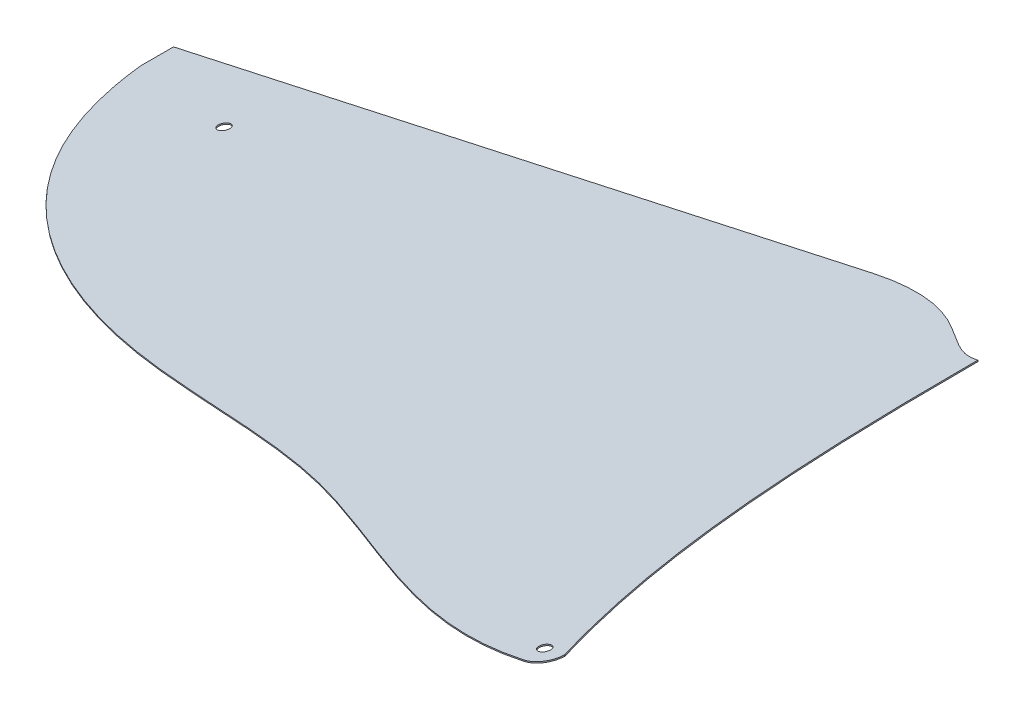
ISO-10303-21;
HEADER;
FILE_DESCRIPTION(('STEP AP214'),'2;1');
FILE_NAME('part.step','',(''),(''),'','','');
FILE_SCHEMA(('AUTOMOTIVE_DESIGN { 1 0 10303 214 1 1 1 1 }'));
ENDSEC;
DATA;
#1=APPLICATION_CONTEXT('core data for automotive mechanical design processes');
#2=APPLICATION_PROTOCOL_DEFINITION('international standard','automotive_design',2000,#1);
#3=PRODUCT_CONTEXT('',#1,'mechanical');
#4=PRODUCT('Part','Part','',(#3));
#5=PRODUCT_RELATED_PRODUCT_CATEGORY('part','',(#4));
#6=PRODUCT_DEFINITION_FORMATION('','',#4);
#7=PRODUCT_DEFINITION_CONTEXT('part definition',#1,'design');
#8=PRODUCT_DEFINITION('design','',#6,#7);
#9=PRODUCT_DEFINITION_SHAPE('','',#8);
#10=(LENGTH_UNIT() NAMED_UNIT(*) SI_UNIT(.MILLI.,.METRE.));
#11=(NAMED_UNIT(*) PLANE_ANGLE_UNIT() SI_UNIT($,.RADIAN.));
#12=(NAMED_UNIT(*) SI_UNIT($,.STERADIAN.) SOLID_ANGLE_UNIT());
#13=UNCERTAINTY_MEASURE_WITH_UNIT(LENGTH_MEASURE(1.E-05),#10,'distance_accuracy_value','');
#14=(GEOMETRIC_REPRESENTATION_CONTEXT(3) GLOBAL_UNCERTAINTY_ASSIGNED_CONTEXT((#13)) GLOBAL_UNIT_ASSIGNED_CONTEXT((#10,
#11,#12)) REPRESENTATION_CONTEXT('',''));
#15=CARTESIAN_POINT('',(0.,0.,0.));
#16=DIRECTION('',(0.,0.,1.));
#17=DIRECTION('',(1.,0.,0.));
#18=AXIS2_PLACEMENT_3D('',#15,#16,#17);
#19=CARTESIAN_POINT('',(-2.617848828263,2.220851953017,-17.129));
#20=DIRECTION('',(-0.21452735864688,0.976717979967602,0.));
#21=DIRECTION('',(-0.976717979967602,-0.21452735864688,0.));
#22=AXIS2_PLACEMENT_3D('',#19,#20,#21);
#23=PLANE('',#22);
#24=CARTESIAN_POINT('',(-142.005271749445,-28.3943473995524,-3.3));
#25=DIRECTION('',(0.214527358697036,-0.976717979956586,0.));
#26=DIRECTION('',(0.976717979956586,0.214527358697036,0.));
#27=AXIS2_PLACEMENT_3D('',#24,#25,#26);
#28=CIRCLE('',#27,1.00000000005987);
#29=CARTESIAN_POINT('',(-141.02855376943,-28.1798200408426,-3.3));
#30=VERTEX_POINT('',#29);
#31=EDGE_CURVE('E96',#30,#30,#28,.F.);
#32=ORIENTED_EDGE('',*,*,#31,.T.);
#33=EDGE_LOOP('',(#32));
#34=FACE_BOUND('',#33,.T.);
#35=CARTESIAN_POINT('',(-9.1716264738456,0.781373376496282,75.2));
#36=DIRECTION('',(0.214527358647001,-0.976717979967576,0.));
#37=DIRECTION('',(0.976717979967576,0.214527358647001,0.));
#38=AXIS2_PLACEMENT_3D('',#35,#36,#37);
#39=CIRCLE('',#38,0.999999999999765);
#40=CARTESIAN_POINT('',(-8.19490849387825,0.995900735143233,75.2));
#41=VERTEX_POINT('',#40);
#42=EDGE_CURVE('E93',#41,#41,#39,.F.);
#43=ORIENTED_EDGE('',*,*,#42,.T.);
#44=EDGE_LOOP('',(#43));
#45=FACE_BOUND('',#44,.T.);
#46=DIRECTION('',(-0.976717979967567,-0.214527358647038,0.));
#47=VECTOR('',#46,1.);
#48=CARTESIAN_POINT('',(-103.2456261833,-19.8811383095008,-15.25));
#49=LINE('',#48,#47);
#50=CARTESIAN_POINT('',(-162.516349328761,-32.8994219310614,-15.25));
#51=VERTEX_POINT('',#50);
#52=CARTESIAN_POINT('',(-43.9748995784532,-6.86285392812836,-15.25));
#53=VERTEX_POINT('',#52);
#54=EDGE_CURVE('E205',#51,#53,#49,.F.);
#55=ORIENTED_EDGE('',*,*,#54,.T.);
#56=CARTESIAN_POINT('',(-43.9748995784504,-6.86285392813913,-15.2500006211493));
#57=CARTESIAN_POINT('',(-43.638383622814,-6.78894121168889,-15.2499893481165));
#58=CARTESIAN_POINT('',(-43.3018689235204,-6.71502877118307,-15.2456346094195));
#59=CARTESIAN_POINT('',(-42.6290148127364,-6.56724239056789,-15.2282786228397));
#60=CARTESIAN_POINT('',(-42.2926754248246,-6.49336845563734,-15.215276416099));
#61=CARTESIAN_POINT('',(-41.6204007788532,-6.34570934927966,-15.1806649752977));
#62=CARTESIAN_POINT('',(-41.284465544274,-6.27192418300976,-15.1590552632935));
#63=CARTESIAN_POINT('',(-40.6132302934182,-6.12449337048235,-15.107197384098));
#64=CARTESIAN_POINT('',(-40.2779302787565,-6.05084772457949,-15.0769491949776));
#65=CARTESIAN_POINT('',(-39.6063469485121,-5.9033404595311,-15.0075456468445));
#66=CARTESIAN_POINT('',(-39.2700683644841,-5.8294798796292,-14.9683422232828));
#67=CARTESIAN_POINT('',(-38.5986238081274,-5.68200309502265,-14.8809927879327));
#68=CARTESIAN_POINT('',(-38.2634578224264,-5.60838688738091,-14.8328468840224));
#69=CARTESIAN_POINT('',(-37.5944850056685,-5.46145299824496,-14.7274338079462));
#70=CARTESIAN_POINT('',(-37.2606782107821,-5.3881353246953,-14.6701663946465));
#71=CARTESIAN_POINT('',(-36.5946826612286,-5.24185536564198,-14.5462817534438));
#72=CARTESIAN_POINT('',(-36.2624941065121,-5.1688931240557,-14.4796633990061));
#73=CARTESIAN_POINT('',(-35.5158923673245,-5.00490873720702,-14.3186593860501));
#74=CARTESIAN_POINT('',(-35.1020415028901,-4.91401010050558,-14.2215198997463));
#75=CARTESIAN_POINT('',(-34.2781137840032,-4.73304175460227,-14.0114914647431));
#76=CARTESIAN_POINT('',(-33.8680373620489,-4.64297214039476,-13.8986007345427));
#77=CARTESIAN_POINT('',(-33.0524576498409,-4.46383735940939,-13.6563359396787));
#78=CARTESIAN_POINT('',(-32.6469552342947,-4.37477238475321,-13.5269587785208));
#79=CARTESIAN_POINT('',(-31.8413790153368,-4.19783478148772,-13.2508208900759));
#80=CARTESIAN_POINT('',(-31.4413082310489,-4.10996281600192,-13.104050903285));
#81=CARTESIAN_POINT('',(-30.6452158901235,-3.93510826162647,-12.7914973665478));
#82=CARTESIAN_POINT('',(-30.2492397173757,-3.84813564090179,-12.6255924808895));
#83=CARTESIAN_POINT('',(-29.4652171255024,-3.6759320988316,-12.2751823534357));
#84=CARTESIAN_POINT('',(-29.077170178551,-3.59070106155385,-12.0906783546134));
#85=CARTESIAN_POINT('',(-28.5021623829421,-3.46440574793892,-11.800025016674));
#86=CARTESIAN_POINT('',(-28.3117910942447,-3.4225923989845,-11.7008929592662));
#87=CARTESIAN_POINT('',(-27.9334261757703,-3.33948793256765,-11.4979715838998));
#88=CARTESIAN_POINT('',(-27.7454325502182,-3.29819681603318,-11.3941822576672));
#89=CARTESIAN_POINT('',(-27.3724244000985,-3.21626891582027,-11.1822377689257));
#90=CARTESIAN_POINT('',(-27.1874035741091,-3.17563074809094,-11.0740942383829));
#91=CARTESIAN_POINT('',(-26.9118365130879,-3.11510491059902,-10.9084662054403));
#92=CARTESIAN_POINT('',(-26.8203082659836,-3.09500155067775,-10.8526881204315));
#93=CARTESIAN_POINT('',(-26.6379255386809,-3.05494281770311,-10.7399890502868));
#94=CARTESIAN_POINT('',(-26.5470710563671,-3.0349874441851,-10.6830680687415));
#95=CARTESIAN_POINT('',(-26.3156768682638,-2.98416378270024,-10.5362145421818));
#96=CARTESIAN_POINT('',(-26.1755967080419,-2.95339642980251,-10.4455227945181));
#97=CARTESIAN_POINT('',(-25.8967790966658,-2.89215663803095,-10.2620057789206));
#98=CARTESIAN_POINT('',(-25.7580416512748,-2.86168420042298,-10.1691805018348));
#99=CARTESIAN_POINT('',(-25.3435022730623,-2.7706343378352,-9.88810561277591));
#100=CARTESIAN_POINT('',(-25.0693808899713,-2.71042603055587,-9.69726182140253));
#101=CARTESIAN_POINT('',(-24.5230830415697,-2.59043659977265,-9.31124411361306));
#102=CARTESIAN_POINT('',(-24.2509131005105,-2.53065690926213,-9.11606061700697));
#103=CARTESIAN_POINT('',(-23.7060150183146,-2.41097492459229,-8.72387508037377));
#104=CARTESIAN_POINT('',(-23.433289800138,-2.35107327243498,-8.52686881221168));
#105=CARTESIAN_POINT('',(-22.8846853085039,-2.23057720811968,-8.13368947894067));
#106=CARTESIAN_POINT('',(-22.6087969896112,-2.16998080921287,-7.93752948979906));
#107=CARTESIAN_POINT('',(-22.1974574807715,-2.07963376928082,-7.65106247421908));
#108=CARTESIAN_POINT('',(-22.0634139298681,-2.05019230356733,-7.55864285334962));
#109=CARTESIAN_POINT('',(-21.7942241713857,-1.99106718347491,-7.37550370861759));
#110=CARTESIAN_POINT('',(-21.6590779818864,-1.961383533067,-7.28478415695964));
#111=CARTESIAN_POINT('',(-21.3874459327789,-1.90172198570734,-7.10551620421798));
#112=CARTESIAN_POINT('',(-21.2509602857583,-1.87174413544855,-7.01696746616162));
#113=CARTESIAN_POINT('',(-20.9763626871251,-1.81143123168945,-6.84252742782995));
#114=CARTESIAN_POINT('',(-20.8382506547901,-1.78109616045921,-6.75663626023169));
#115=CARTESIAN_POINT('',(-20.6301212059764,-1.73538239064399,-6.63049014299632));
#116=CARTESIAN_POINT('',(-20.5608068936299,-1.72015812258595,-6.58901780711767));
#117=CARTESIAN_POINT('',(-20.4216879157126,-1.68960188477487,-6.50694508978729));
#118=CARTESIAN_POINT('',(-20.35188324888,-1.67426991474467,-6.46634471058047));
#119=CARTESIAN_POINT('',(-20.1415647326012,-1.6280753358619,-6.34619867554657));
#120=CARTESIAN_POINT('',(-20.0001393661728,-1.59701252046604,-6.26830382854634));
#121=CARTESIAN_POINT('',(-19.7154303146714,-1.53447872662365,-6.11950854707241));
#122=CARTESIAN_POINT('',(-19.5721756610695,-1.5030141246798,-6.04855040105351));
#123=CARTESIAN_POINT('',(-19.2821359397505,-1.43930949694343,-5.91458743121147));
#124=CARTESIAN_POINT('',(-19.1353509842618,-1.40706949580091,-5.8515823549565));
#125=CARTESIAN_POINT('',(-18.8386906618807,-1.34191071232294,-5.73518222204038));
#126=CARTESIAN_POINT('',(-18.6888263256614,-1.30899435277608,-5.68175788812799));
#127=CARTESIAN_POINT('',(-18.3859650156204,-1.24247357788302,-5.58528745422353));
#128=CARTESIAN_POINT('',(-18.2329687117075,-1.20886930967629,-5.54223915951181));
#129=CARTESIAN_POINT('',(-17.9355675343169,-1.14354780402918,-5.4696394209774));
#130=CARTESIAN_POINT('',(-17.7913362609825,-1.11186869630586,-5.43933988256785));
#131=CARTESIAN_POINT('',(-17.5009449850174,-1.04808685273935,-5.38787146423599));
#132=CARTESIAN_POINT('',(-17.3547809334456,-1.01598322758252,-5.36672660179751));
#133=CARTESIAN_POINT('',(-17.0574774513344,-0.950683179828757,-5.33281378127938));
#134=CARTESIAN_POINT('',(-16.9063116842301,-0.917480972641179,-5.32029202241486));
#135=CARTESIAN_POINT('',(-16.6039704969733,-0.851074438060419,-5.30388748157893));
#136=CARTESIAN_POINT('',(-16.4527963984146,-0.817870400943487,-5.2999795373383));
#137=CARTESIAN_POINT('',(-16.3016677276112,-0.784676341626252,-5.30000000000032));
#138=B_SPLINE_CURVE_WITH_KNOTS('',3,(#56,#57,#58,#59,#60,#61,#62,#63,#64,#65,#66,#67,#68,#69,
#70,#71,#72,#73,#74,#75,#76,#77,#78,#79,#80,#81,#82,#83,#84,#85,#86,#87,#88,#89,#90,#91,#92,#93,
#94,#95,#96,#97,#98,#99,#100,#101,#102,#103,#104,#105,#106,#107,#108,#109,#110,#111,#112,#113,
#114,#115,#116,#117,#118,#119,#120,#121,#122,#123,#124,#125,#126,#127,#128,#129,#130,#131,#132,
#133,#134,#135,#136,#137),.UNSPECIFIED.,.F.,.F.,(4,2,2,2,2,2,2,2,2,2,2,2,2,2,2,2,2,2,2,2,2,2,2,
2,2,2,2,2,2,2,2,2,2,2,2,2,2,2,2,2,4),(0.,1.03358335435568,2.06728133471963,3.10103672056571,
4.13479473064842,5.1742372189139,6.21366716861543,7.25312460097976,8.29270736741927,
9.59653504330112,10.9005103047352,12.2047308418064,13.5096488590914,14.8233506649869,
16.1369647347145,16.7929236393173,17.448883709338,18.1031946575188,18.4303495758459,
18.7575034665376,19.2665430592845,19.7755848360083,20.793695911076,21.8143364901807,
22.8395283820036,23.8711813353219,24.3675410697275,24.8638926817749,25.3601667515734,
25.8564655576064,26.10304826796,26.3496316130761,26.842773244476,27.3313818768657,
27.8199749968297,28.3070486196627,28.7940191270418,29.2459621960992,29.6990838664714,
30.1646589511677,30.6288722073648),.UNSPECIFIED.);
#139=CARTESIAN_POINT('',(-16.3016677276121,-0.784676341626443,-5.30000000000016));
#140=VERTEX_POINT('',#139);
#141=EDGE_CURVE('E133',#53,#140,#138,.T.);
#142=ORIENTED_EDGE('',*,*,#141,.T.);
#143=CARTESIAN_POINT('',(-16.301667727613,-0.784676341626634,-5.30000000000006));
#144=CARTESIAN_POINT('',(-16.3016574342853,-0.784674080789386,-3.53900113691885));
#145=CARTESIAN_POINT('',(-16.2962456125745,-0.783485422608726,-1.7779698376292));
#146=CARTESIAN_POINT('',(-16.271028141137,-0.777946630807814,1.74406631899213));
#147=CARTESIAN_POINT('',(-16.2512217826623,-0.773596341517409,3.50507117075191));
#148=CARTESIAN_POINT('',(-16.1935820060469,-0.760936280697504,7.02934263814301));
#149=CARTESIAN_POINT('',(-16.1557224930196,-0.752620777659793,8.79260883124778));
#150=CARTESIAN_POINT('',(-16.0582885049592,-0.731220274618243,12.3185194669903));
#151=CARTESIAN_POINT('',(-15.9987141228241,-0.718135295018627,14.0811639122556));
#152=CARTESIAN_POINT('',(-15.8541007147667,-0.686372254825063,17.6060376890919));
#153=CARTESIAN_POINT('',(-15.7690521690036,-0.667692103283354,19.3682666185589));
#154=CARTESIAN_POINT('',(-15.5697382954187,-0.62391459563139,22.8909567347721));
#155=CARTESIAN_POINT('',(-15.4554738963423,-0.598817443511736,24.6514179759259));
#156=CARTESIAN_POINT('',(-15.1940779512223,-0.541404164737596,28.1680659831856));
#157=CARTESIAN_POINT('',(-15.0469788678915,-0.509095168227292,29.924255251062));
#158=CARTESIAN_POINT('',(-14.7160806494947,-0.436416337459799,33.4332593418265));
#159=CARTESIAN_POINT('',(-14.5322766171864,-0.396045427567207,35.1860736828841));
#160=CARTESIAN_POINT('',(-14.0760705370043,-0.295843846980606,39.1004718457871));
#161=CARTESIAN_POINT('',(-13.7929959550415,-0.233669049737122,41.2607710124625));
#162=CARTESIAN_POINT('',(-13.1583604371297,-0.0942770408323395,45.5709131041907));
#163=CARTESIAN_POINT('',(-12.8067982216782,-0.0170595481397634,47.7207558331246));
#164=CARTESIAN_POINT('',(-12.0289780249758,0.153781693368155,52.0058063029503));
#165=CARTESIAN_POINT('',(-11.6027364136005,0.247401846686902,54.1410171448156));
#166=CARTESIAN_POINT('',(-10.6671981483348,0.452884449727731,58.4050623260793));
#167=CARTESIAN_POINT('',(-10.1574478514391,0.56484653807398,60.53379325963));
#168=CARTESIAN_POINT('',(-9.32818309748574,0.74698711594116,63.7094277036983));
#169=CARTESIAN_POINT('',(-9.04093213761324,0.810079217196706,64.7652461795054));
#170=CARTESIAN_POINT('',(-8.44439864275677,0.941102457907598,66.8703499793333));
#171=CARTESIAN_POINT('',(-8.13511628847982,1.00903355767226,67.9196353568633));
#172=CARTESIAN_POINT('',(-7.49375193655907,1.14990349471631,70.0120963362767));
#173=CARTESIAN_POINT('',(-7.16164619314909,1.22284754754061,71.0552643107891));
#174=CARTESIAN_POINT('',(-6.47459144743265,1.37375297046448,73.1337213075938));
#175=CARTESIAN_POINT('',(-6.11964168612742,1.45171450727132,74.1690100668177));
#176=CARTESIAN_POINT('',(-5.75311354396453,1.5322191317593,75.2000000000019));
#177=B_SPLINE_CURVE_WITH_KNOTS('',3,(#143,#144,#145,#146,#147,#148,#149,#150,#151,#152,#153,
#154,#155,#156,#157,#158,#159,#160,#161,#162,#163,#164,#165,#166,#167,#168,#169,#170,#171,#172,
#173,#174,#175,#176),.UNSPECIFIED.,.F.,.F.,(4,2,2,2,2,2,2,2,2,2,2,2,2,2,2,2,4),(0.,
5.28303713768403,10.5663344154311,15.8572916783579,21.1482263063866,26.4411406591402,
31.7338867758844,37.0214231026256,42.3096653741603,48.8475669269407,55.385590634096,
61.9221829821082,68.4955390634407,71.7833727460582,75.0711794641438,78.3624602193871,
81.6538503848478),.UNSPECIFIED.);
#178=CARTESIAN_POINT('',(-5.75311354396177,1.53221913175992,75.2000000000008));
#179=VERTEX_POINT('',#178);
#180=EDGE_CURVE('E77',#140,#179,#177,.T.);
#181=ORIENTED_EDGE('',*,*,#180,.T.);
#182=CARTESIAN_POINT('',(-9.17162647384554,0.781373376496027,75.2));
#183=DIRECTION('',(0.214527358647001,-0.976717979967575,0.));
#184=DIRECTION('',(0.976717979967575,0.214527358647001,0.));
#185=AXIS2_PLACEMENT_3D('',#182,#183,#184);
#186=CIRCLE('',#185,3.50000000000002);
#187=CARTESIAN_POINT('',(-9.17162647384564,0.781373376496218,78.7));
#188=VERTEX_POINT('',#187);
#189=EDGE_CURVE('E72',#179,#188,#186,.T.);
#190=ORIENTED_EDGE('',*,*,#189,.T.);
#191=CARTESIAN_POINT('',(-9.17162647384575,0.781373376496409,78.7000000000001));
#192=CARTESIAN_POINT('',(-9.577487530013,0.692229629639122,78.7000044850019));
#193=CARTESIAN_POINT('',(-9.98332844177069,0.603090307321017,78.6946243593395));
#194=CARTESIAN_POINT('',(-10.7947311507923,0.424872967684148,78.6732559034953));
#195=CARTESIAN_POINT('',(-11.2002929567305,0.335794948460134,78.657267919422));
#196=CARTESIAN_POINT('',(-12.4125616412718,0.0695309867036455,78.5938257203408));
#197=CARTESIAN_POINT('',(-13.2185402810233,-0.107495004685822,78.5308899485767));
#198=CARTESIAN_POINT('',(-14.8243866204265,-0.460204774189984,78.3656484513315));
#199=CARTESIAN_POINT('',(-15.6242649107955,-0.635890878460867,78.2634487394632));
#200=CARTESIAN_POINT('',(-17.2176584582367,-0.985865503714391,78.0220973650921));
#201=CARTESIAN_POINT('',(-18.0111803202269,-1.16015547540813,77.8829912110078));
#202=CARTESIAN_POINT('',(-19.5915761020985,-1.50727525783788,77.5704076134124));
#203=CARTESIAN_POINT('',(-20.378451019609,-1.68010528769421,77.3969354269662));
#204=CARTESIAN_POINT('',(-21.9289911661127,-2.02066754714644,77.0222875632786));
#205=CARTESIAN_POINT('',(-22.6928032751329,-2.18843203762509,76.8217458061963));
#206=CARTESIAN_POINT('',(-24.2135412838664,-2.52244852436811,76.3930077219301));
#207=CARTESIAN_POINT('',(-24.9704618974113,-2.6886993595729,76.1647918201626));
#208=CARTESIAN_POINT('',(-26.4772201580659,-3.01964531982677,75.683472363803));
#209=CARTESIAN_POINT('',(-27.2270529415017,-3.18433937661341,75.430352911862));
#210=CARTESIAN_POINT('',(-28.7194635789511,-3.51213400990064,74.9020575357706));
#211=CARTESIAN_POINT('',(-29.4620394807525,-3.67523415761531,74.6268758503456));
#212=CARTESIAN_POINT('',(-30.9397718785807,-3.99980484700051,74.0573319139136));
#213=CARTESIAN_POINT('',(-31.6749312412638,-4.16127601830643,73.7629774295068));
#214=CARTESIAN_POINT('',(-33.4623559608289,-4.55386785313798,73.0237033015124));
#215=CARTESIAN_POINT('',(-34.5110626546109,-4.78420688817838,72.5697717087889));
#216=CARTESIAN_POINT('',(-36.5961047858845,-5.24216772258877,71.6348872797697));
#217=CARTESIAN_POINT('',(-37.6324470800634,-5.46979102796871,71.1539503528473));
#218=CARTESIAN_POINT('',(-39.6960167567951,-5.92303563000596,70.1716063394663));
#219=CARTESIAN_POINT('',(-40.723242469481,-6.14865655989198,69.6701955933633));
#220=CARTESIAN_POINT('',(-42.771672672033,-6.59857591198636,68.6531836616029));
#221=CARTESIAN_POINT('',(-43.7928733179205,-6.82287348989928,68.137574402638));
#222=CARTESIAN_POINT('',(-45.8322698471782,-7.27080867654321,67.0982660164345));
#223=CARTESIAN_POINT('',(-46.8504629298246,-7.49444567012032,66.5745611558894));
#224=CARTESIAN_POINT('',(-48.8868213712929,-7.94171356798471,65.5250837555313));
#225=CARTESIAN_POINT('',(-49.9049860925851,-8.16534433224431,64.9993099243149));
#226=CARTESIAN_POINT('',(-51.950695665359,-8.61466612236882,63.9484289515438));
#227=CARTESIAN_POINT('',(-52.9782558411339,-8.84036051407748,63.4233529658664));
#228=CARTESIAN_POINT('',(-55.0385223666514,-9.29287960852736,62.3839409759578));
#229=CARTESIAN_POINT('',(-56.0712284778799,-9.51970425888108,61.8696044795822));
#230=CARTESIAN_POINT('',(-57.6259265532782,-9.8611797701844,61.1112487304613));
#231=CARTESIAN_POINT('',(-58.1449001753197,-9.97516767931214,60.8607479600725));
#232=CARTESIAN_POINT('',(-59.1852003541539,-10.2036602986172,60.3649105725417));
#233=CARTESIAN_POINT('',(-59.7065269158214,-10.3181650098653,60.1195739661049));
#234=CARTESIAN_POINT('',(-60.7512335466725,-10.5476254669,59.6352295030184));
#235=CARTESIAN_POINT('',(-61.2746104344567,-10.6625805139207,59.3962144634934));
#236=CARTESIAN_POINT('',(-62.3243347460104,-10.8931430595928,58.9251195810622));
#237=CARTESIAN_POINT('',(-62.8506821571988,-11.0087505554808,58.6930397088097));
#238=CARTESIAN_POINT('',(-63.9059951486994,-11.2405406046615,58.2370076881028));
#239=CARTESIAN_POINT('',(-64.4349568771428,-11.3567223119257,58.013046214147));
#240=CARTESIAN_POINT('',(-65.496375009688,-11.5898533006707,57.5739799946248));
#241=CARTESIAN_POINT('',(-66.0288314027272,-11.7068025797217,57.3588752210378));
#242=CARTESIAN_POINT('',(-67.0964090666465,-11.9412864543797,56.9373343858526));
#243=CARTESIAN_POINT('',(-67.6315272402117,-12.0588203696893,56.7308900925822));
#244=CARTESIAN_POINT('',(-68.7046255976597,-12.294516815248,56.3259442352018));
#245=CARTESIAN_POINT('',(-69.2426058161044,-12.4126793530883,56.1274427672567));
#246=CARTESIAN_POINT('',(-70.6667712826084,-12.725484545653,55.6130283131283));
#247=CARTESIAN_POINT('',(-71.555128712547,-12.9206043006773,55.3034075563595));
#248=CARTESIAN_POINT('',(-73.3375103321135,-13.3120884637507,54.7017795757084));
#249=CARTESIAN_POINT('',(-74.2315346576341,-13.5084529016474,54.4097727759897));
#250=CARTESIAN_POINT('',(-76.9221975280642,-14.0994329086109,53.5558157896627));
#251=CARTESIAN_POINT('',(-78.7256936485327,-14.4955546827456,53.016543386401));
#252=CARTESIAN_POINT('',(-82.3464464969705,-15.2908206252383,51.9761251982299));
#253=CARTESIAN_POINT('',(-84.1637222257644,-15.6899689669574,51.475050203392));
#254=CARTESIAN_POINT('',(-87.8059527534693,-16.4899522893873,50.4889992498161));
#255=CARTESIAN_POINT('',(-89.6309155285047,-16.8907890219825,50.004054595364));
#256=CARTESIAN_POINT('',(-93.2823713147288,-17.6927985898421,49.0282485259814));
#257=CARTESIAN_POINT('',(-95.1088623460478,-18.0939709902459,48.5373791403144));
#258=CARTESIAN_POINT('',(-97.8445398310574,-18.6948380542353,47.7805401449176));
#259=CARTESIAN_POINT('',(-98.7563712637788,-18.8951136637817,47.524657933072));
#260=CARTESIAN_POINT('',(-100.57748157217,-19.295104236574,47.0035136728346));
#261=CARTESIAN_POINT('',(-101.486760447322,-19.4948191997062,46.7382516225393));
#262=CARTESIAN_POINT('',(-103.291558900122,-19.8912270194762,46.198885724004));
#263=CARTESIAN_POINT('',(-104.187117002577,-20.0879283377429,45.9249174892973));
#264=CARTESIAN_POINT('',(-105.974030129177,-20.4804078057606,45.3629421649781));
#265=CARTESIAN_POINT('',(-106.865385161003,-20.6761859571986,45.074935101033));
#266=CARTESIAN_POINT('',(-108.642794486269,-21.0665780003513,44.4826860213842));
#267=CARTESIAN_POINT('',(-109.528849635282,-21.2611920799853,44.1784467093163));
#268=CARTESIAN_POINT('',(-110.853255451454,-21.5520859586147,43.7082990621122));
#269=CARTESIAN_POINT('',(-111.293946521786,-21.6488798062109,43.5492843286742));
#270=CARTESIAN_POINT('',(-112.17364595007,-21.8420979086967,43.2264491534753));
#271=CARTESIAN_POINT('',(-112.612654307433,-21.9385221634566,43.0626287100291));
#272=CARTESIAN_POINT('',(-113.925861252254,-22.2269563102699,42.5643679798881));
#273=CARTESIAN_POINT('',(-114.797456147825,-22.4183943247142,42.2226977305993));
#274=CARTESIAN_POINT('',(-116.533026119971,-22.7995967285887,41.5196233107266));
#275=CARTESIAN_POINT('',(-117.397001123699,-22.9893611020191,41.1582189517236));
#276=CARTESIAN_POINT('',(-119.115156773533,-23.3667386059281,40.4158036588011));
#277=CARTESIAN_POINT('',(-119.969351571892,-23.5543548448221,40.0348270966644));
#278=CARTESIAN_POINT('',(-121.668624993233,-23.9275850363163,39.2521380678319));
#279=CARTESIAN_POINT('',(-122.513703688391,-24.1131990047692,38.8504257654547));
#280=CARTESIAN_POINT('',(-124.192553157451,-24.4819432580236,38.0262671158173));
#281=CARTESIAN_POINT('',(-125.026339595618,-24.6650769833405,37.6038542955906));
#282=CARTESIAN_POINT('',(-126.682910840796,-25.028928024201,36.7370402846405));
#283=CARTESIAN_POINT('',(-127.505695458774,-25.2096452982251,36.292638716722));
#284=CARTESIAN_POINT('',(-129.954721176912,-25.7475518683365,34.9259950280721));
#285=CARTESIAN_POINT('',(-131.563104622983,-26.1008188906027,33.9695964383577));
#286=CARTESIAN_POINT('',(-133.863799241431,-26.6061458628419,32.5051059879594));
#287=CARTESIAN_POINT('',(-134.579626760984,-26.7633709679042,32.0353497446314));
#288=CARTESIAN_POINT('',(-135.997900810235,-27.0748821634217,31.0747021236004));
#289=CARTESIAN_POINT('',(-136.700344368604,-27.2291676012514,30.5838061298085));
#290=CARTESIAN_POINT('',(-138.090373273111,-27.5344750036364,29.5803009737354));
#291=CARTESIAN_POINT('',(-138.777957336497,-27.6854966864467,29.0676899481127));
#292=CARTESIAN_POINT('',(-140.136792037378,-27.9839525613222,28.0200898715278));
#293=CARTESIAN_POINT('',(-140.808041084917,-28.1313864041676,27.4850986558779));
#294=CARTESIAN_POINT('',(-142.135427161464,-28.4229348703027,26.3897493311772));
#295=CARTESIAN_POINT('',(-142.791484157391,-28.5670319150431,25.8292894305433));
#296=CARTESIAN_POINT('',(-144.08356301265,-28.8508254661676,24.6846548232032));
#297=CARTESIAN_POINT('',(-144.719585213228,-28.9905220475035,24.1004805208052));
#298=CARTESIAN_POINT('',(-145.969576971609,-29.2650715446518,22.9079613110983));
#299=CARTESIAN_POINT('',(-146.58354812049,-29.3999248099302,22.299618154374));
#300=CARTESIAN_POINT('',(-147.787403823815,-29.6643409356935,21.0582892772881));
#301=CARTESIAN_POINT('',(-148.377285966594,-29.7939032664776,20.4253011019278));
#302=CARTESIAN_POINT('',(-149.537848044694,-30.0488103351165,19.1264199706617));
#303=CARTESIAN_POINT('',(-150.108194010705,-30.174081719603,18.4602137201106));
#304=CARTESIAN_POINT('',(-151.219334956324,-30.4181338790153,17.102300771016));
#305=CARTESIAN_POINT('',(-151.760126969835,-30.5369140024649,16.4105915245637));
#306=CARTESIAN_POINT('',(-152.809441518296,-30.7673865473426,15.002005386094));
#307=CARTESIAN_POINT('',(-153.317966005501,-30.8790793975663,14.2851300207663));
#308=CARTESIAN_POINT('',(-154.300350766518,-31.0948514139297,12.8268132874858));
#309=CARTESIAN_POINT('',(-154.774209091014,-31.1989301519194,12.0853705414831));
#310=CARTESIAN_POINT('',(-155.683650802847,-31.3986808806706,10.5816112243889));
#311=CARTESIAN_POINT('',(-156.119354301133,-31.4943792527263,9.81937085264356));
#312=CARTESIAN_POINT('',(-156.952498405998,-31.677371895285,8.27314514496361));
#313=CARTESIAN_POINT('',(-157.349934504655,-31.7646651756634,7.48915726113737));
#314=CARTESIAN_POINT('',(-158.105062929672,-31.9305223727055,5.90155756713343));
#315=CARTESIAN_POINT('',(-158.462762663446,-32.0090879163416,5.09794944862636));
#316=CARTESIAN_POINT('',(-159.137479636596,-32.1572834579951,3.47343515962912));
#317=CARTESIAN_POINT('',(-159.45451585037,-32.2269176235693,2.65253726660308));
#318=CARTESIAN_POINT('',(-159.916133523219,-32.3283078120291,1.363023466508));
#319=CARTESIAN_POINT('',(-160.074835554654,-32.3631652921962,0.899650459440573));
#320=CARTESIAN_POINT('',(-160.379564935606,-32.4300963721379,-0.0313283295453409));
#321=CARTESIAN_POINT('',(-160.525595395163,-32.462170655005,-0.498933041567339));
#322=CARTESIAN_POINT('',(-160.805049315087,-32.5235502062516,-1.43800944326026));
#323=CARTESIAN_POINT('',(-160.938474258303,-32.5528558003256,-1.90948067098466));
#324=CARTESIAN_POINT('',(-161.192827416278,-32.6087221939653,-2.85593161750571));
#325=CARTESIAN_POINT('',(-161.313755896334,-32.6352830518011,-3.33091126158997));
#326=CARTESIAN_POINT('',(-161.543470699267,-32.6857378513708,-4.2849013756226));
#327=CARTESIAN_POINT('',(-161.6522333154,-32.7096265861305,-4.76391782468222));
#328=CARTESIAN_POINT('',(-161.857524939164,-32.7547170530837,-5.724713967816));
#329=CARTESIAN_POINT('',(-161.954053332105,-32.775918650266,-6.20649379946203));
#330=CARTESIAN_POINT('',(-162.135075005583,-32.8156784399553,-7.17242951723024));
#331=CARTESIAN_POINT('',(-162.219567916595,-32.834236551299,-7.65658547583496));
#332=CARTESIAN_POINT('',(-162.376750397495,-32.8687602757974,-8.62688620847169));
#333=CARTESIAN_POINT('',(-162.449440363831,-32.8847259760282,-9.11303091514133));
#334=CARTESIAN_POINT('',(-162.516349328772,-32.8994219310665,-9.60000000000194));
#335=B_SPLINE_CURVE_WITH_KNOTS('',3,(#191,#192,#193,#194,#195,#196,#197,#198,#199,#200,#201,
#202,#203,#204,#205,#206,#207,#208,#209,#210,#211,#212,#213,#214,#215,#216,#217,#218,#219,#220,
#221,#222,#223,#224,#225,#226,#227,#228,#229,#230,#231,#232,#233,#234,#235,#236,#237,#238,#239,
#240,#241,#242,#243,#244,#245,#246,#247,#248,#249,#250,#251,#252,#253,#254,#255,#256,#257,#258,
#259,#260,#261,#262,#263,#264,#265,#266,#267,#268,#269,#270,#271,#272,#273,#274,#275,#276,#277,
#278,#279,#280,#281,#282,#283,#284,#285,#286,#287,#288,#289,#290,#291,#292,#293,#294,#295,#296,
#297,#298,#299,#300,#301,#302,#303,#304,#305,#306,#307,#308,#309,#310,#311,#312,#313,#314,#315,
#316,#317,#318,#319,#320,#321,#322,#323,#324,#325,#326,#327,#328,#329,#330,#331,#332,#333,#334),
.UNSPECIFIED.,.F.,.F.,(4,2,2,2,2,2,2,2,2,2,2,2,2,2,2,2,2,2,2,2,2,2,2,2,2,2,2,2,2,2,2,2,2,2,2,2,
2,2,2,2,2,2,2,2,2,2,2,2,2,2,2,2,2,2,2,2,2,2,2,2,2,2,2,2,2,2,2,2,2,2,2,4),(0.,1.24653279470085,
2.49302492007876,4.97469310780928,7.44970729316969,9.92168367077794,12.3932821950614,
14.8147034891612,17.237847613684,19.6625487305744,22.087885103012,24.5122450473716,
28.0088698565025,31.5034559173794,34.9986693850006,38.495913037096,41.9957585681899,
45.4983262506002,49.0257268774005,52.5529655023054,54.3152418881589,56.077521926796,
57.8377051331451,59.5978808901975,61.3559661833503,63.1140459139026,64.8704148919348,
66.6268051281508,69.5089457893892,72.3911558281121,78.1612037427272,83.9416974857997,
89.7328227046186,95.5328780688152,98.4368372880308,101.340797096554,104.211584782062,
107.082367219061,109.952672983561,111.38783863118,112.823004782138,115.689390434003,
118.555803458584,121.417344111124,124.278862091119,127.135889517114,129.992965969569,
135.702121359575,138.313402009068,140.92525577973,143.537334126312,146.149665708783,
148.773559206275,151.397407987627,154.021067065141,156.644988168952,159.301845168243,
161.958968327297,164.615930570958,167.273042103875,169.921463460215,172.570196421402,
175.218434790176,177.865432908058,179.338376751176,180.810958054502,182.283365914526,
183.755742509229,185.230939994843,186.706211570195,188.181528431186,189.656795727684),.UNSPECIFIED.);
#336=CARTESIAN_POINT('',(-162.516349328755,-32.8994219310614,-9.60000000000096));
#337=VERTEX_POINT('',#336);
#338=EDGE_CURVE('E21',#188,#337,#335,.T.);
#339=ORIENTED_EDGE('',*,*,#338,.T.);
#340=DIRECTION('',(0.,0.,1.));
#341=VECTOR('',#340,1.);
#342=CARTESIAN_POINT('',(-162.516349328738,-32.8994219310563,-12.4249999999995));
#343=LINE('',#342,#341);
#344=EDGE_CURVE('E200',#337,#51,#343,.F.);
#345=ORIENTED_EDGE('',*,*,#344,.T.);
#346=EDGE_LOOP('',(#55,#142,#181,#190,#339,#345));
#347=FACE_BOUND('',#346,.T.);
#348=ADVANCED_FACE('F16',(#34,#45,#347),#23,.F.);
#349=CARTESIAN_POINT('',(-7.362769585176,1.387535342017,78.66247188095));
#350=CARTESIAN_POINT('',(-7.983154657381,1.251273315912,78.6876692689));
#351=CARTESIAN_POINT('',(-28.90687387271,-3.34443425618,79.1054902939));
#352=CARTESIAN_POINT('',(-60.66998569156,-10.32091735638,54.51567693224));
#353=CARTESIAN_POINT('',(-112.3091784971,-21.66300367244,46.67202631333));
#354=CARTESIAN_POINT('',(-151.460288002,-30.26219431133,23.49322009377));
#355=CARTESIAN_POINT('',(-161.4828484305,-32.46355996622,-0.682376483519));
#356=CARTESIAN_POINT('',(-162.7245564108,-32.73629000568,-10.86872133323));
#357=CARTESIAN_POINT('',(-162.7931592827,-32.75135801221,-11.51289203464));
#358=B_SPLINE_CURVE_WITH_KNOTS('',3,(#349,#350,#351,#352,#353,#354,#355,#356,#357),
.UNSPECIFIED.,.F.,.F.,(4,1,1,1,1,1,4),(0.,0.009666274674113,0.3275371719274,0.5861839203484,
0.8538980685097,0.9908550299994,1.),.UNSPECIFIED.);
#359=DIRECTION('',(0.214527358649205,-0.976717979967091,0.));
#360=VECTOR('',#359,1.);
#361=SURFACE_OF_LINEAR_EXTRUSION('',#358,#360);
#362=ORIENTED_EDGE('',*,*,#338,.F.);
#363=DIRECTION('',(-0.214527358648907,0.976717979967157,0.));
#364=VECTOR('',#363,1.);
#365=CARTESIAN_POINT('',(-9.1930792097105,0.87904517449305,78.7));
#366=LINE('',#365,#364);
#367=CARTESIAN_POINT('',(-9.21453194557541,0.976716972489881,78.7));
#368=VERTEX_POINT('',#367);
#369=EDGE_CURVE('E80',#188,#368,#366,.T.);
#370=ORIENTED_EDGE('',*,*,#369,.T.);
#371=CARTESIAN_POINT('',(-9.21453195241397,0.976716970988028,78.7000000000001));
#372=CARTESIAN_POINT('',(-9.62039300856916,0.887573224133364,78.7000044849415));
#373=CARTESIAN_POINT('',(-10.026233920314,0.798433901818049,78.6946243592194));
#374=CARTESIAN_POINT('',(-10.8376366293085,0.620216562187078,78.6732559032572));
#375=CARTESIAN_POINT('',(-11.2431984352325,0.531138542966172,78.6572679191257));
#376=CARTESIAN_POINT('',(-12.4554671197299,0.264874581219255,78.593825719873));
#377=CARTESIAN_POINT('',(-13.2614457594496,0.0878485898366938,78.5308899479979));
#378=CARTESIAN_POINT('',(-14.8672920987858,-0.264861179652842,78.3656484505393));
#379=CARTESIAN_POINT('',(-15.6671703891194,-0.440547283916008,78.2634487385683));
#380=CARTESIAN_POINT('',(-17.260563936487,-0.79052190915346,78.0220973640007));
#381=CARTESIAN_POINT('',(-18.0540857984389,-0.964811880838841,77.8829912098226));
#382=CARTESIAN_POINT('',(-19.6344815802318,-1.31193166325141,77.5704076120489));
#383=CARTESIAN_POINT('',(-20.421356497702,-1.48476169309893,77.3969354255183));
#384=CARTESIAN_POINT('',(-21.9718966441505,-1.82532395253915,77.0222875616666));
#385=CARTESIAN_POINT('',(-22.7357087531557,-1.99308844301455,76.8217458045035));
#386=CARTESIAN_POINT('',(-24.2564467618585,-2.32710492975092,76.393007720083));
#387=CARTESIAN_POINT('',(-25.0133673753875,-2.49335576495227,76.1647918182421));
#388=CARTESIAN_POINT('',(-26.5201256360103,-2.82430172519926,75.6834723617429));
#389=CARTESIAN_POINT('',(-27.2699584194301,-2.98899578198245,75.4303529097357));
#390=CARTESIAN_POINT('',(-28.7623690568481,-3.31679041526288,74.9020575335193));
#391=CARTESIAN_POINT('',(-29.5049449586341,-3.47989056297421,74.6268758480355));
#392=CARTESIAN_POINT('',(-30.9826773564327,-3.804461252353,74.0573319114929));
#393=CARTESIAN_POINT('',(-31.7178367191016,-3.96593242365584,73.7629774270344));
#394=CARTESIAN_POINT('',(-33.5052614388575,-4.35852425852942,73.0237032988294));
#395=CARTESIAN_POINT('',(-34.5539681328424,-4.58886329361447,72.5697717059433));
#396=CARTESIAN_POINT('',(-36.6390102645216,-5.04682412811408,71.6348872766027));
#397=CARTESIAN_POINT('',(-37.6753525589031,-5.27444743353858,71.1539503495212));
#398=CARTESIAN_POINT('',(-39.7389222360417,-5.72769203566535,70.1716063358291));
#399=CARTESIAN_POINT('',(-40.7661479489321,-5.95331296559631,69.670195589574));
#400=CARTESIAN_POINT('',(-42.8145781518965,-6.40323231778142,68.65318365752));
#401=CARTESIAN_POINT('',(-43.8357787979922,-6.62752989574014,68.1375743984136));
#402=CARTESIAN_POINT('',(-45.8751753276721,-7.07546508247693,67.098266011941));
#403=CARTESIAN_POINT('',(-46.8933684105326,-7.29910207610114,66.5745611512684));
#404=CARTESIAN_POINT('',(-48.9297268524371,-7.74636997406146,65.5250837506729));
#405=CARTESIAN_POINT('',(-49.9478915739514,-7.97000073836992,64.9993099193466));
#406=CARTESIAN_POINT('',(-51.9936011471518,-8.41932252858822,63.9484289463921));
#407=CARTESIAN_POINT('',(-53.0211613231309,-8.64501692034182,63.423352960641));
#408=CARTESIAN_POINT('',(-55.0814278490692,-9.09753601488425,62.3839409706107));
#409=CARTESIAN_POINT('',(-56.114133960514,-9.32436066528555,61.8696044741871));
#410=CARTESIAN_POINT('',(-57.6688320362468,-9.66583617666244,61.1112487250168));
#411=CARTESIAN_POINT('',(-58.1878056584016,-9.77982408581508,60.8607479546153));
#412=CARTESIAN_POINT('',(-59.2281058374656,-10.0083167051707,60.3649105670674));
#413=CARTESIAN_POINT('',(-59.7494323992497,-10.1228214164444,60.1195739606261));
#414=CARTESIAN_POINT('',(-60.794139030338,-10.3522818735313,59.6352294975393));
#415=CARTESIAN_POINT('',(-61.3175159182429,-10.4672369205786,59.3962144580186));
#416=CARTESIAN_POINT('',(-62.3672402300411,-10.6977994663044,58.9251195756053));
#417=CARTESIAN_POINT('',(-62.8935876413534,-10.8134069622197,58.6930397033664));
#418=CARTESIAN_POINT('',(-63.9489006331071,-11.0451970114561,58.237007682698));
#419=CARTESIAN_POINT('',(-64.4778623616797,-11.1613787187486,58.0130462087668));
#420=CARTESIAN_POINT('',(-65.5392804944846,-11.3945097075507,57.5739799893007));
#421=CARTESIAN_POINT('',(-66.0717368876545,-11.5114589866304,57.3588752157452));
#422=CARTESIAN_POINT('',(-67.1393145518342,-11.7459428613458,56.9373343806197));
#423=CARTESIAN_POINT('',(-67.6744327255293,-11.863476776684,56.7308900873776));
#424=CARTESIAN_POINT('',(-68.7475310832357,-12.0991732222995,56.3259442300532));
#425=CARTESIAN_POINT('',(-69.2855113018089,-12.217335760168,56.1274427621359));
#426=CARTESIAN_POINT('',(-70.7096767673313,-12.5301409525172,55.6130283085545));
#427=CARTESIAN_POINT('',(-71.5980341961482,-12.7252607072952,55.3034075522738));
#428=CARTESIAN_POINT('',(-73.3804158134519,-13.1167448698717,54.7017795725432));
#429=CARTESIAN_POINT('',(-74.2744401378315,-13.3131093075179,54.409772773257));
#430=CARTESIAN_POINT('',(-76.9651030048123,-13.9040893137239,53.5558157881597));
#431=CARTESIAN_POINT('',(-78.7685991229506,-14.3002110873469,53.0165433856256));
#432=CARTESIAN_POINT('',(-82.3893519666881,-15.0954770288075,51.9761251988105));
#433=CARTESIAN_POINT('',(-84.206627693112,-15.4946253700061,51.4750502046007));
#434=CARTESIAN_POINT('',(-87.8488582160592,-16.2946086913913,50.4889992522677));
#435=CARTESIAN_POINT('',(-89.673820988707,-16.6954454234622,50.0040545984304));
#436=CARTESIAN_POINT('',(-93.3252767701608,-17.4974549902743,49.0282485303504));
#437=CARTESIAN_POINT('',(-95.1517677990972,-17.8986273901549,48.5373791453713));
#438=CARTESIAN_POINT('',(-97.8874452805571,-18.4994944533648,47.7805401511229));
#439=CARTESIAN_POINT('',(-98.7992767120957,-18.6997700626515,47.5246579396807));
#440=CARTESIAN_POINT('',(-100.620387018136,-19.0997606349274,47.0035136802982));
#441=CARTESIAN_POINT('',(-101.529665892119,-19.2994755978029,46.7382516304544));
#442=CARTESIAN_POINT('',(-103.334464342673,-19.6958834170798,46.1988857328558));
#443=CARTESIAN_POINT('',(-104.23002244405,-19.89258473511,45.9249174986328));
#444=CARTESIAN_POINT('',(-106.016935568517,-20.2850642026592,45.3629421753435));
#445=CARTESIAN_POINT('',(-106.908290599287,-20.4808423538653,45.0749351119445));
#446=CARTESIAN_POINT('',(-108.685699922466,-20.8712343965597,44.4826860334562));
#447=CARTESIAN_POINT('',(-109.571755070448,-21.0658484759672,44.1784467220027));
#448=CARTESIAN_POINT('',(-110.896160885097,-21.3567423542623,43.7082990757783));
#449=CARTESIAN_POINT('',(-111.336851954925,-21.4535362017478,43.5492843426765));
#450=CARTESIAN_POINT('',(-112.216551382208,-21.6467543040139,43.2264491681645));
#451=CARTESIAN_POINT('',(-112.655559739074,-21.7431785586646,43.0626287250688));
#452=CARTESIAN_POINT('',(-113.968766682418,-22.0316127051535,42.5643679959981));
#453=CARTESIAN_POINT('',(-114.840361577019,-22.2230507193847,42.2226977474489));
#454=CARTESIAN_POINT('',(-116.575931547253,-22.6042531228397,41.5196233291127));
#455=CARTESIAN_POINT('',(-117.439906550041,-22.7940174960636,41.1582189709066));
#456=CARTESIAN_POINT('',(-119.158062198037,-23.1713949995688,40.4158036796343));
#457=CARTESIAN_POINT('',(-120.012256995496,-23.3590112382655,40.0348271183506));
#458=CARTESIAN_POINT('',(-121.711530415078,-23.7322414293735,39.2521380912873));
#459=CARTESIAN_POINT('',(-122.556609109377,-23.9178553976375,38.8504257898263));
#460=CARTESIAN_POINT('',(-124.23545857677,-24.2865996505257,38.0262671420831));
#461=CARTESIAN_POINT('',(-125.069245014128,-24.4697333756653,37.6038543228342));
#462=CARTESIAN_POINT('',(-126.725816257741,-24.833584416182,36.7370403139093));
#463=CARTESIAN_POINT('',(-127.548600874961,-25.0143016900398,36.2926387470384));
#464=CARTESIAN_POINT('',(-129.997626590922,-25.5522082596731,34.9259950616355));
#465=CARTESIAN_POINT('',(-131.606010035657,-25.9054752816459,33.9695964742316));
#466=CARTESIAN_POINT('',(-133.906704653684,-26.410802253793,32.5051060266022));
#467=CARTESIAN_POINT('',(-134.622532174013,-26.5680273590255,32.0353497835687));
#468=CARTESIAN_POINT('',(-136.040806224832,-26.8795385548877,31.0747021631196));
#469=CARTESIAN_POINT('',(-136.743249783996,-27.0338239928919,30.5838061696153));
#470=CARTESIAN_POINT('',(-138.133278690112,-27.3391313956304,29.5803010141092));
#471=CARTESIAN_POINT('',(-138.820862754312,-27.4901530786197,29.0676899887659));
#472=CARTESIAN_POINT('',(-140.179697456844,-27.7886089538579,28.0200899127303));
#473=CARTESIAN_POINT('',(-140.85094650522,-27.9360427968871,27.4850986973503));
#474=CARTESIAN_POINT('',(-142.178332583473,-28.227591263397,26.3897493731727));
#475=CARTESIAN_POINT('',(-142.83438958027,-28.3716883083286,25.8292894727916));
#476=CARTESIAN_POINT('',(-144.126468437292,-28.6554818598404,24.6846548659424));
#477=CARTESIAN_POINT('',(-144.762490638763,-28.7951784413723,24.1004805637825));
#478=CARTESIAN_POINT('',(-146.012482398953,-29.0697279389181,22.9079613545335));
#479=CARTESIAN_POINT('',(-146.62645354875,-29.2045812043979,22.2996181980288));
#480=CARTESIAN_POINT('',(-147.830309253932,-29.4689973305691,21.0582893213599));
#481=CARTESIAN_POINT('',(-148.420191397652,-29.5985596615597,20.4253011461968));
#482=CARTESIAN_POINT('',(-149.580753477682,-29.8534667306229,19.1264200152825));
#483=CARTESIAN_POINT('',(-150.151099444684,-29.9787381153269,18.4602137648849));
#484=CARTESIAN_POINT('',(-151.262240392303,-30.2227902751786,17.1023008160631));
#485=CARTESIAN_POINT('',(-151.803032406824,-30.34157039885,16.4105915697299));
#486=CARTESIAN_POINT('',(-152.852346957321,-30.572042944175,15.0020054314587));
#487=CARTESIAN_POINT('',(-153.360871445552,-30.6837357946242,14.2851300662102));
#488=CARTESIAN_POINT('',(-154.343256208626,-30.8995078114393,12.8268133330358));
#489=CARTESIAN_POINT('',(-154.817114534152,-31.0035865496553,12.0853705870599));
#490=CARTESIAN_POINT('',(-155.726556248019,-31.2033372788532,10.5816112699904));
#491=CARTESIAN_POINT('',(-156.162259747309,-31.2990356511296,9.81937089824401));
#492=CARTESIAN_POINT('',(-156.995403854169,-31.4820282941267,8.2731451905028));
#493=CARTESIAN_POINT('',(-157.392839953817,-31.5693215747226,7.48915730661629));
#494=CARTESIAN_POINT('',(-158.147968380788,-31.735178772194,5.90155761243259));
#495=CARTESIAN_POINT('',(-158.505668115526,-31.8137443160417,5.09794949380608));
#496=CARTESIAN_POINT('',(-159.180385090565,-31.9619398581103,3.47343520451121));
#497=CARTESIAN_POINT('',(-159.497421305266,-32.0315740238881,2.65253731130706));
#498=CARTESIAN_POINT('',(-159.959038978,-32.1329642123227,1.36302351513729));
#499=CARTESIAN_POINT('',(-160.117741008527,-32.1678216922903,0.899650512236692));
#500=CARTESIAN_POINT('',(-160.422470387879,-32.2347527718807,-0.0313282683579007));
#501=CARTESIAN_POINT('',(-160.568500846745,-32.266827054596,-0.498932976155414));
#502=CARTESIAN_POINT('',(-160.847954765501,-32.328206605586,-1.43800936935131));
#503=CARTESIAN_POINT('',(-160.98137970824,-32.3575121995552,-1.90948059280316));
#504=CARTESIAN_POINT('',(-161.235732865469,-32.4133785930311,-2.85593153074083));
#505=CARTESIAN_POINT('',(-161.356661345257,-32.439939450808,-3.33091117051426));
#506=CARTESIAN_POINT('',(-161.586376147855,-32.490394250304,-4.28490127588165));
#507=CARTESIAN_POINT('',(-161.695138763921,-32.5142829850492,-4.76391772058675));
#508=CARTESIAN_POINT('',(-161.90043038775,-32.5593734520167,-5.72471385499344));
#509=CARTESIAN_POINT('',(-161.996958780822,-32.5805750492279,-6.20649368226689));
#510=CARTESIAN_POINT('',(-162.177980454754,-32.6203348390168,-7.17242939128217));
#511=CARTESIAN_POINT('',(-162.262473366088,-32.6388929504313,-7.65658534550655));
#512=CARTESIAN_POINT('',(-162.419655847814,-32.6734166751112,-8.62688606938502));
#513=CARTESIAN_POINT('',(-162.492345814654,-32.6893823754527,-9.11303077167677));
#514=CARTESIAN_POINT('',(-162.559254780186,-32.7040783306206,-9.5999998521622));
#515=B_SPLINE_CURVE_WITH_KNOTS('',3,(#371,#372,#373,#374,#375,#376,#377,#378,#379,#380,#381,
#382,#383,#384,#385,#386,#387,#388,#389,#390,#391,#392,#393,#394,#395,#396,#397,#398,#399,#400,
#401,#402,#403,#404,#405,#406,#407,#408,#409,#410,#411,#412,#413,#414,#415,#416,#417,#418,#419,
#420,#421,#422,#423,#424,#425,#426,#427,#428,#429,#430,#431,#432,#433,#434,#435,#436,#437,#438,
#439,#440,#441,#442,#443,#444,#445,#446,#447,#448,#449,#450,#451,#452,#453,#454,#455,#456,#457,
#458,#459,#460,#461,#462,#463,#464,#465,#466,#467,#468,#469,#470,#471,#472,#473,#474,#475,#476,
#477,#478,#479,#480,#481,#482,#483,#484,#485,#486,#487,#488,#489,#490,#491,#492,#493,#494,#495,
#496,#497,#498,#499,#500,#501,#502,#503,#504,#505,#506,#507,#508,#509,#510,#511,#512,#513,#514),
.UNSPECIFIED.,.F.,.F.,(4,2,2,2,2,2,2,2,2,2,2,2,2,2,2,2,2,2,2,2,2,2,2,2,2,2,2,2,2,2,2,2,2,2,2,2,
2,2,2,2,2,2,2,2,2,2,2,2,2,2,2,2,2,2,2,2,2,2,2,2,2,2,2,2,2,2,2,2,2,2,2,4),(0.,1.24653279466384,
2.49302492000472,4.97469310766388,7.449707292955,9.92168367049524,12.3932821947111,
14.8147034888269,17.2378476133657,19.6625487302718,22.0878851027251,24.5122450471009,
28.0088698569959,31.5034559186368,34.9986693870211,38.4959130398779,41.9957585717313,
45.4983262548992,49.0257268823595,52.5529655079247,54.315241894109,56.077521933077,
57.8377051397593,59.5978808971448,61.3559661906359,63.1140459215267,64.8704148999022,
66.6268051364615,69.5089457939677,72.3911558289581,78.1612037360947,83.9416974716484,
89.7328226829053,95.5328780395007,98.4368372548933,101.340797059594,104.211584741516,
107.08236717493,109.952672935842,111.387838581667,112.82300473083,115.68939037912,
118.555803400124,121.417344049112,124.278862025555,127.135889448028,129.992965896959,
135.702121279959,138.313401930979,140.92525570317,143.537334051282,146.149665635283,
148.773559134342,151.397407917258,154.021066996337,156.644988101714,159.301845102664,
161.958968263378,164.615930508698,167.27304204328,169.92146340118,172.570196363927,
175.218434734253,177.865432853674,179.338376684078,180.81095797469,182.283365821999,
183.755742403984,185.230939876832,186.706211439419,188.181528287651,189.656795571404),.UNSPECIFIED.);
#516=CARTESIAN_POINT('',(-162.559254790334,-32.7040783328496,-9.59999992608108));
#517=VERTEX_POINT('',#516);
#518=EDGE_CURVE('E183',#368,#517,#515,.T.);
#519=ORIENTED_EDGE('',*,*,#518,.T.);
#520=DIRECTION('',(-0.214527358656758,0.976717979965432,0.));
#521=VECTOR('',#520,1.);
#522=CARTESIAN_POINT('',(-162.5378020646,-32.801750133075,-9.6));
#523=LINE('',#522,#521);
#524=EDGE_CURVE('E87',#517,#337,#523,.F.);
#525=ORIENTED_EDGE('',*,*,#524,.T.);
#526=EDGE_LOOP('',(#362,#370,#519,#525));
#527=FACE_BOUND('',#526,.T.);
#528=ADVANCED_FACE('F84',(#527),#361,.T.);
#529=CARTESIAN_POINT('',(-162.5154912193,-32.90332880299,-15.5554585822));
#530=DIRECTION('',(-0.976717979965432,-0.214527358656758,0.));
#531=DIRECTION('',(0.,0.,1.));
#532=AXIS2_PLACEMENT_3D('',#529,#530,#531);
#533=PLANE('',#532);
#534=ORIENTED_EDGE('',*,*,#344,.F.);
#535=ORIENTED_EDGE('',*,*,#524,.F.);
#536=DIRECTION('',(0.,0.,1.));
#537=VECTOR('',#536,1.);
#538=CARTESIAN_POINT('',(-162.559254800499,-32.7040783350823,31.725));
#539=LINE('',#538,#537);
#540=CARTESIAN_POINT('',(-162.559254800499,-32.7040783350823,-15.25));
#541=VERTEX_POINT('',#540);
#542=EDGE_CURVE('E177',#517,#541,#539,.F.);
#543=ORIENTED_EDGE('',*,*,#542,.T.);
#544=DIRECTION('',(-0.214527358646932,0.976717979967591,0.));
#545=VECTOR('',#544,1.);
#546=CARTESIAN_POINT('',(-162.537802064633,-32.8017501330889,-15.25));
#547=LINE('',#546,#545);
#548=EDGE_CURVE('E202',#541,#51,#547,.F.);
#549=ORIENTED_EDGE('',*,*,#548,.T.);
#550=EDGE_LOOP('',(#534,#535,#543,#549));
#551=FACE_BOUND('',#550,.T.);
#552=ADVANCED_FACE('F143',(#551),#533,.T.);
#553=CARTESIAN_POINT('',(-41.60321600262,-6.346030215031,-15.25));
#554=DIRECTION('',(0.,0.,-1.));
#555=DIRECTION('',(-0.976717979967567,-0.214527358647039,0.));
#556=AXIS2_PLACEMENT_3D('',#553,#554,#555);
#557=PLANE('',#556);
#558=ORIENTED_EDGE('',*,*,#54,.F.);
#559=ORIENTED_EDGE('',*,*,#548,.F.);
#560=DIRECTION('',(-0.976717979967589,-0.21452735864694,0.));
#561=VECTOR('',#560,1.);
#562=CARTESIAN_POINT('',(-84.1776369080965,-15.4882578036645,-15.25));
#563=LINE('',#562,#561);
#564=CARTESIAN_POINT('',(-44.02476075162,-6.66903808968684,-15.25));
#565=VERTEX_POINT('',#564);
#566=EDGE_CURVE('E174',#541,#565,#563,.F.);
#567=ORIENTED_EDGE('',*,*,#566,.T.);
#568=DIRECTION('',(0.249147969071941,-0.96846543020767,0.));
#569=VECTOR('',#568,1.);
#570=CARTESIAN_POINT('',(-44.02476075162,-6.669038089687,-15.25));
#571=LINE('',#570,#569);
#572=EDGE_CURVE('E206',#565,#53,#571,.T.);
#573=ORIENTED_EDGE('',*,*,#572,.T.);
#574=EDGE_LOOP('',(#558,#559,#567,#573));
#575=FACE_BOUND('',#574,.T.);
#576=ADVANCED_FACE('F147',(#575),#557,.T.);
#577=CARTESIAN_POINT('',(-44.32485299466,-6.730855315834,-15.24879400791));
#578=CARTESIAN_POINT('',(-44.22530700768,-6.708990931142,-15.24957921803));
#579=CARTESIAN_POINT('',(-40.25696943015,-5.83738111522,-15.26560890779));
#580=CARTESIAN_POINT('',(-33.86817387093,-4.434139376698,-14.3779661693));
#581=CARTESIAN_POINT('',(-26.18456090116,-2.746502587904,-10.77699034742));
#582=CARTESIAN_POINT('',(-21.37361691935,-1.689821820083,-6.751535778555));
#583=CARTESIAN_POINT('',(-18.0571706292,-0.9613940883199,-5.269180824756));
#584=CARTESIAN_POINT('',(-16.14034309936,-0.5403800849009,-5.301758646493));
#585=CARTESIAN_POINT('',(-16.0348991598,-0.5172202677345,-5.305345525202));
#586=B_SPLINE_CURVE_WITH_KNOTS('',3,(#577,#578,#579,#580,#581,#582,#583,#584,#585),
.UNSPECIFIED.,.F.,.F.,(4,1,1,1,1,1,4),(0.,0.01018163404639,0.4050606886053,0.6058914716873,
0.8482152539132,0.9918062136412,1.),.UNSPECIFIED.);
#587=DIRECTION('',(0.214527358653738,-0.976717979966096,0.));
#588=VECTOR('',#587,1.);
#589=SURFACE_OF_LINEAR_EXTRUSION('',#586,#588);
#590=ORIENTED_EDGE('',*,*,#141,.F.);
#591=ORIENTED_EDGE('',*,*,#572,.F.);
#592=CARTESIAN_POINT('',(-44.02476075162,-6.66903808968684,-15.2500000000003));
#593=CARTESIAN_POINT('',(-43.6881732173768,-6.59510965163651,-15.2500488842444));
#594=CARTESIAN_POINT('',(-43.3515862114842,-6.52118132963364,-15.2457520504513));
#595=CARTESIAN_POINT('',(-42.6785861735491,-6.37336289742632,-15.2285078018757));
#596=CARTESIAN_POINT('',(-42.3421731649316,-6.29947279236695,-15.2155594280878));
#597=CARTESIAN_POINT('',(-41.6697500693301,-6.15178108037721,-15.1810520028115));
#598=CARTESIAN_POINT('',(-41.3337400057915,-6.07797947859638,-15.1594924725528));
#599=CARTESIAN_POINT('',(-40.6623539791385,-5.93051554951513,-15.1077316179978));
#600=CARTESIAN_POINT('',(-40.3269780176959,-5.85685322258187,-15.0775302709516));
#601=CARTESIAN_POINT('',(-39.6552273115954,-5.70930919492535,-15.008216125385));
#602=CARTESIAN_POINT('',(-39.3188573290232,-5.63542854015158,-14.9690548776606));
#603=CARTESIAN_POINT('',(-38.6472291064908,-5.48791141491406,-14.8817861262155));
#604=CARTESIAN_POINT('',(-38.3119708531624,-5.41427494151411,-14.8336787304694));
#605=CARTESIAN_POINT('',(-37.6428127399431,-5.26730035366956,-14.7283391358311));
#606=CARTESIAN_POINT('',(-37.3089129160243,-5.19396224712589,-14.6711066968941));
#607=CARTESIAN_POINT('',(-36.6427306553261,-5.04764127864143,-14.5472885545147));
#608=CARTESIAN_POINT('',(-36.3104484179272,-4.9746584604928,-14.4807017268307));
#609=CARTESIAN_POINT('',(-35.5636716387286,-4.81063562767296,-14.3197728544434));
#610=CARTESIAN_POINT('',(-35.1497389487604,-4.71971901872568,-14.2226773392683));
#611=CARTESIAN_POINT('',(-34.3256459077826,-4.53871436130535,-14.0127342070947));
#612=CARTESIAN_POINT('',(-33.9154859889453,-4.44862640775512,-13.8998848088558));
#613=CARTESIAN_POINT('',(-33.0997373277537,-4.26945451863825,-13.6577000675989));
#614=CARTESIAN_POINT('',(-32.6941494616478,-4.18037077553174,-13.5283616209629));
#615=CARTESIAN_POINT('',(-31.8884001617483,-4.00339515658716,-13.2522981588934));
#616=CARTESIAN_POINT('',(-31.4882417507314,-3.91550394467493,-13.1055638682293));
#617=CARTESIAN_POINT('',(-30.6919862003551,-3.74061354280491,-12.7930830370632));
#618=CARTESIAN_POINT('',(-30.2959341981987,-3.65362426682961,-12.6272157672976));
#619=CARTESIAN_POINT('',(-29.5117585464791,-3.48138710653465,-12.2768768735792));
#620=CARTESIAN_POINT('',(-29.1236343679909,-3.39613910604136,-12.0924064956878));
#621=CARTESIAN_POINT('',(-28.5485101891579,-3.26981822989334,-11.8017998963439));
#622=CARTESIAN_POINT('',(-28.3581000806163,-3.22799635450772,-11.7026828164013));
#623=CARTESIAN_POINT('',(-27.9796573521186,-3.14487479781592,-11.4997900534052));
#624=CARTESIAN_POINT('',(-27.7916247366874,-3.10357511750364,-11.3960143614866));
#625=CARTESIAN_POINT('',(-27.4185386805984,-3.02163010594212,-11.1840957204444));
#626=CARTESIAN_POINT('',(-27.233478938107,-2.9809833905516,-11.0759644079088));
#627=CARTESIAN_POINT('',(-26.9578535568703,-2.92044474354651,-10.91035356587));
#628=CARTESIAN_POINT('',(-26.8663058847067,-2.9003371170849,-10.8545810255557));
#629=CARTESIAN_POINT('',(-26.6838842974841,-2.86026984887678,-10.7418927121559));
#630=CARTESIAN_POINT('',(-26.593010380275,-2.84031020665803,-10.6849769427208));
#631=CARTESIAN_POINT('',(-26.3615744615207,-2.78947737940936,-10.5381388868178));
#632=CARTESIAN_POINT('',(-26.2214725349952,-2.75870524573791,-10.447456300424));
#633=CARTESIAN_POINT('',(-25.9426131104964,-2.69745627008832,-10.2639543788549));
#634=CARTESIAN_POINT('',(-25.8038556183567,-2.6669794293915,-10.1711350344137));
#635=CARTESIAN_POINT('',(-25.3892584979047,-2.57591688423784,-9.89007316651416));
#636=CARTESIAN_POINT('',(-25.1151020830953,-2.5157008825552,-9.69923185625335));
#637=CARTESIAN_POINT('',(-24.5687411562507,-2.39569759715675,-9.3132085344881));
#638=CARTESIAN_POINT('',(-24.2965431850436,-2.33591175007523,-9.11801691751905));
#639=CARTESIAN_POINT('',(-23.7515965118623,-2.21621909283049,-8.7258058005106));
#640=CARTESIAN_POINT('',(-23.4788507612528,-2.15631293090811,-8.5287820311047));
#641=CARTESIAN_POINT('',(-22.9302135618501,-2.0358096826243,-8.13555912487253));
#642=CARTESIAN_POINT('',(-22.6543131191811,-1.97521062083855,-7.93937298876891));
#643=CARTESIAN_POINT('',(-22.2429563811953,-1.8848597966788,-7.65285661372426));
#644=CARTESIAN_POINT('',(-22.1089051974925,-1.85541665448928,-7.560417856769));
#645=CARTESIAN_POINT('',(-21.8397015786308,-1.79628849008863,-7.37723797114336));
#646=CARTESIAN_POINT('',(-21.7045491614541,-1.76660347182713,-7.28649681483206));
#647=CARTESIAN_POINT('',(-21.4329061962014,-1.7069395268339,-7.10718327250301));
#648=CARTESIAN_POINT('',(-21.2964158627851,-1.67696064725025,-7.01861054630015));
#649=CARTESIAN_POINT('',(-21.0218102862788,-1.61664599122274,-6.8441196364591));
#650=CARTESIAN_POINT('',(-20.883694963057,-1.58631019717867,-6.75820158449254));
#651=CARTESIAN_POINT('',(-20.675560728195,-1.54059537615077,-6.63201320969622));
#652=CARTESIAN_POINT('',(-20.6062446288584,-1.52537071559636,-6.5905263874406));
#653=CARTESIAN_POINT('',(-20.4671228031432,-1.49481385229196,-6.5084230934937));
#654=CARTESIAN_POINT('',(-20.3973170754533,-1.47948164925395,-6.46780662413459));
#655=CARTESIAN_POINT('',(-20.1869971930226,-1.43328677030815,-6.34760809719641));
#656=CARTESIAN_POINT('',(-20.0455734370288,-1.40222430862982,-6.26967268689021));
#657=CARTESIAN_POINT('',(-19.7608696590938,-1.33969167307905,-6.12078675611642));
#658=CARTESIAN_POINT('',(-19.6176186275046,-1.30822786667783,-6.04977864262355));
#659=CARTESIAN_POINT('',(-19.3275867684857,-1.24452496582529,-5.91570787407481));
#660=CARTESIAN_POINT('',(-19.1808060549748,-1.21228589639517,-5.85264496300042));
#661=CARTESIAN_POINT('',(-18.8841527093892,-1.14712864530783,-5.73612439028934));
#662=CARTESIAN_POINT('',(-18.7342911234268,-1.11421288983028,-5.68263744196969));
#663=CARTESIAN_POINT('',(-18.4314316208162,-1.04769251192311,-5.58604002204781));
#664=CARTESIAN_POINT('',(-18.2784343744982,-1.01408803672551,-5.54292735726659));
#665=CARTESIAN_POINT('',(-17.9808346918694,-0.948722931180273,-5.47015814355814));
#666=CARTESIAN_POINT('',(-17.8364032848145,-0.91699986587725,-5.43976586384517));
#667=CARTESIAN_POINT('',(-17.5456038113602,-0.853128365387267,-5.3881397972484));
#668=CARTESIAN_POINT('',(-17.3992316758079,-0.820979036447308,-5.36693010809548));
#669=CARTESIAN_POINT('',(-17.1014981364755,-0.755584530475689,-5.33291326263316));
#670=CARTESIAN_POINT('',(-16.9501102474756,-0.722333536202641,-5.32035329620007));
#671=CARTESIAN_POINT('',(-16.6473231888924,-0.655829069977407,-5.3038989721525));
#672=CARTESIAN_POINT('',(-16.4959253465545,-0.622575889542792,-5.29997938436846));
#673=CARTESIAN_POINT('',(-16.3445731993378,-0.589332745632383,-5.30000000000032));
#674=B_SPLINE_CURVE_WITH_KNOTS('',3,(#592,#593,#594,#595,#596,#597,#598,#599,#600,#601,#602,
#603,#604,#605,#606,#607,#608,#609,#610,#611,#612,#613,#614,#615,#616,#617,#618,#619,#620,#621,
#622,#623,#624,#625,#626,#627,#628,#629,#630,#631,#632,#633,#634,#635,#636,#637,#638,#639,#640,
#641,#642,#643,#644,#645,#646,#647,#648,#649,#650,#651,#652,#653,#654,#655,#656,#657,#658,#659,
#660,#661,#662,#663,#664,#665,#666,#667,#668,#669,#670,#671,#672,#673),.UNSPECIFIED.,.F.,.F.,(4,
2,2,2,2,2,2,2,2,2,2,2,2,2,2,2,2,2,2,2,2,2,2,2,2,2,2,2,2,2,2,2,2,2,2,2,2,2,2,2,4),(0.,
1.03380317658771,2.06772096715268,3.10169625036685,4.13567425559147,5.17538130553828,
6.21507580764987,7.2547976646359,8.29464458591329,9.59868773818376,10.9028784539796,
12.2073150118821,13.5124502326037,14.8263248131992,16.1401114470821,16.7961562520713,
17.4522023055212,18.1065988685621,18.4337965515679,18.7609931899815,19.2700745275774,
19.7791580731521,20.7973536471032,21.8180786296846,22.8433523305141,23.8750808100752,
24.3714920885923,24.8678952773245,25.364220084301,25.8605694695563,26.1071788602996,
26.3537889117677,26.8469843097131,27.3356486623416,27.8242972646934,28.3114248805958,
28.7984494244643,29.251049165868,29.7048295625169,30.171092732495,30.6359925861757),.UNSPECIFIED.);
#675=CARTESIAN_POINT('',(-16.3445731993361,-0.589332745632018,-5.30000000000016));
#676=VERTEX_POINT('',#675);
#677=EDGE_CURVE('E173',#565,#676,#674,.T.);
#678=ORIENTED_EDGE('',*,*,#677,.T.);
#679=DIRECTION('',(0.214527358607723,-0.976717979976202,0.));
#680=VECTOR('',#679,1.);
#681=CARTESIAN_POINT('',(-16.3454313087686,-0.585425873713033,-5.3));
#682=LINE('',#681,#680);
#683=EDGE_CURVE('E107',#676,#140,#682,.T.);
#684=ORIENTED_EDGE('',*,*,#683,.T.);
#685=EDGE_LOOP('',(#590,#591,#678,#684));
#686=FACE_BOUND('',#685,.T.);
#687=ADVANCED_FACE('F118',(#686),#589,.T.);
#688=CARTESIAN_POINT('',(-16.34504923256,-0.585341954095,-6.116558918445));
#689=CARTESIAN_POINT('',(-16.37111023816,-0.5910660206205,21.97008571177));
#690=CARTESIAN_POINT('',(-15.08658895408,-0.3089324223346,49.53205437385));
#691=CARTESIAN_POINT('',(-5.521616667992,1.791928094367,75.96748060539));
#692=B_SPLINE_CURVE_WITH_KNOTS('',3,(#688,#689,#690,#691),.UNSPECIFIED.,.F.,.F.,(4,4),(0.,1.),.UNSPECIFIED.);
#693=DIRECTION('',(0.214527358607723,-0.976717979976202,0.));
#694=VECTOR('',#693,1.);
#695=SURFACE_OF_LINEAR_EXTRUSION('',#692,#694);
#696=ORIENTED_EDGE('',*,*,#180,.F.);
#697=ORIENTED_EDGE('',*,*,#683,.F.);
#698=CARTESIAN_POINT('',(-16.3445731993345,-0.589332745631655,-5.30000000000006));
#699=CARTESIAN_POINT('',(-16.3445629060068,-0.589330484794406,-3.53900113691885));
#700=CARTESIAN_POINT('',(-16.339151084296,-0.588141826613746,-1.7779698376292));
#701=CARTESIAN_POINT('',(-16.3139336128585,-0.582603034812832,1.74406631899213));
#702=CARTESIAN_POINT('',(-16.2941272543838,-0.578252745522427,3.50507117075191));
#703=CARTESIAN_POINT('',(-16.2364874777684,-0.565592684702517,7.02934263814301));
#704=CARTESIAN_POINT('',(-16.1986279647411,-0.557277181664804,8.79260883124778));
#705=CARTESIAN_POINT('',(-16.1011939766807,-0.535876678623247,12.3185194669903));
#706=CARTESIAN_POINT('',(-16.0416195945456,-0.522791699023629,14.0811639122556));
#707=CARTESIAN_POINT('',(-15.8970061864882,-0.491028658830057,17.6060376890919));
#708=CARTESIAN_POINT('',(-15.8119576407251,-0.472348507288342,19.3682666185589));
#709=CARTESIAN_POINT('',(-15.6126437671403,-0.428570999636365,22.8909567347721));
#710=CARTESIAN_POINT('',(-15.4983793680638,-0.403473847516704,24.6514179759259));
#711=CARTESIAN_POINT('',(-15.2369834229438,-0.346060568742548,28.1680659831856));
#712=CARTESIAN_POINT('',(-15.089884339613,-0.313751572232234,29.924255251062));
#713=CARTESIAN_POINT('',(-14.7589861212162,-0.241072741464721,33.4332593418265));
#714=CARTESIAN_POINT('',(-14.5751820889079,-0.200701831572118,35.1860736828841));
#715=CARTESIAN_POINT('',(-14.1189760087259,-0.100500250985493,39.100471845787));
#716=CARTESIAN_POINT('',(-13.8359014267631,-0.0383254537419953,41.2607710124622));
#717=CARTESIAN_POINT('',(-13.2012659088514,0.101066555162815,45.5709131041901));
#718=CARTESIAN_POINT('',(-12.8497036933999,0.178284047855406,47.7207558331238));
#719=CARTESIAN_POINT('',(-12.0718834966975,0.349125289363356,52.0058063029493));
#720=CARTESIAN_POINT('',(-11.6456418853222,0.442745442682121,54.1410171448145));
#721=CARTESIAN_POINT('',(-10.7101036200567,0.648228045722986,58.4050623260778));
#722=CARTESIAN_POINT('',(-10.200353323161,0.760190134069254,60.5337932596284));
#723=CARTESIAN_POINT('',(-9.37108856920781,0.942330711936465,63.7094277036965));
#724=CARTESIAN_POINT('',(-9.08383760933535,1.00542281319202,64.7652461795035));
#725=CARTESIAN_POINT('',(-8.48730411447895,1.13644605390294,66.8703499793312));
#726=CARTESIAN_POINT('',(-8.17802176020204,1.20437715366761,67.9196353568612));
#727=CARTESIAN_POINT('',(-7.53665740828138,1.34524709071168,70.0120963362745));
#728=CARTESIAN_POINT('',(-7.20455166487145,1.418191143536,71.0552643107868));
#729=CARTESIAN_POINT('',(-6.5174969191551,1.56909656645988,73.1337213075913));
#730=CARTESIAN_POINT('',(-6.16254715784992,1.64705810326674,74.1690100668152));
#731=CARTESIAN_POINT('',(-5.79601901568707,1.72756272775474,75.1999999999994));
#732=B_SPLINE_CURVE_WITH_KNOTS('',3,(#698,#699,#700,#701,#702,#703,#704,#705,#706,#707,#708,
#709,#710,#711,#712,#713,#714,#715,#716,#717,#718,#719,#720,#721,#722,#723,#724,#725,#726,#727,
#728,#729,#730,#731),.UNSPECIFIED.,.F.,.F.,(4,2,2,2,2,2,2,2,2,2,2,2,2,2,2,2,4),(0.,
5.28303713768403,10.5663344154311,15.8572916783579,21.1482263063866,26.4411406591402,
31.7338867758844,37.0214231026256,42.3096653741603,48.8475669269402,55.3855906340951,
61.9221829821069,68.4955390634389,71.7833727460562,75.0711794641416,78.3624602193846,
81.653850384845),.UNSPECIFIED.);
#733=CARTESIAN_POINT('',(-5.79601901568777,1.72756272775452,75.1999999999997));
#734=VERTEX_POINT('',#733);
#735=EDGE_CURVE('E41',#676,#734,#732,.T.);
#736=ORIENTED_EDGE('',*,*,#735,.T.);
#737=DIRECTION('',(0.214527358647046,-0.976717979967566,-1.93488387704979E-12));
#738=VECTOR('',#737,1.);
#739=CARTESIAN_POINT('',(-5.77456627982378,1.6298909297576,75.1999999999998));
#740=LINE('',#739,#738);
#741=EDGE_CURVE('E81',#734,#179,#740,.T.);
#742=ORIENTED_EDGE('',*,*,#741,.T.);
#743=EDGE_LOOP('',(#696,#697,#736,#742));
#744=FACE_BOUND('',#743,.T.);
#745=ADVANCED_FACE('F113',(#744),#695,.T.);
#746=CARTESIAN_POINT('',(-9.214531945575,0.9767169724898,75.2));
#747=DIRECTION('',(0.214527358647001,-0.976717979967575,0.));
#748=DIRECTION('',(0.976717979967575,0.214527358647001,0.));
#749=AXIS2_PLACEMENT_3D('',#746,#747,#748);
#750=CYLINDRICAL_SURFACE('',#749,3.50000000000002);
#751=ORIENTED_EDGE('',*,*,#189,.F.);
#752=ORIENTED_EDGE('',*,*,#741,.F.);
#753=CARTESIAN_POINT('',(-9.214531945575,0.9767169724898,75.2));
#754=DIRECTION('',(0.214527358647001,-0.976717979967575,0.));
#755=DIRECTION('',(0.976717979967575,0.214527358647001,0.));
#756=AXIS2_PLACEMENT_3D('',#753,#754,#755);
#757=CIRCLE('',#756,3.50000000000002);
#758=EDGE_CURVE('E91',#734,#368,#757,.T.);
#759=ORIENTED_EDGE('',*,*,#758,.T.);
#760=ORIENTED_EDGE('',*,*,#369,.F.);
#761=EDGE_LOOP('',(#751,#752,#759,#760));
#762=FACE_BOUND('',#761,.T.);
#763=ADVANCED_FACE('F89',(#762),#750,.T.);
#764=CARTESIAN_POINT('',(-9.21453194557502,0.976716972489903,75.2));
#765=DIRECTION('',(0.214527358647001,-0.976717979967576,0.));
#766=DIRECTION('',(0.976717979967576,0.214527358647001,0.));
#767=AXIS2_PLACEMENT_3D('',#764,#765,#766);
#768=CYLINDRICAL_SURFACE('',#767,0.999999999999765);
#769=ORIENTED_EDGE('',*,*,#42,.F.);
#770=EDGE_LOOP('',(#769));
#771=FACE_BOUND('',#770,.T.);
#772=CARTESIAN_POINT('',(-9.21453194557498,0.976716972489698,75.2));
#773=DIRECTION('',(0.214527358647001,-0.976717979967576,0.));
#774=DIRECTION('',(0.976717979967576,0.214527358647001,0.));
#775=AXIS2_PLACEMENT_3D('',#772,#773,#774);
#776=CIRCLE('',#775,0.999999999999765);
#777=CARTESIAN_POINT('',(-8.23781396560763,1.19124433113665,75.2));
#778=VERTEX_POINT('',#777);
#779=EDGE_CURVE('E32',#778,#778,#776,.F.);
#780=ORIENTED_EDGE('',*,*,#779,.T.);
#781=EDGE_LOOP('',(#780));
#782=FACE_BOUND('',#781,.T.);
#783=ADVANCED_FACE('F163',(#771,#782),#768,.F.);
#784=CARTESIAN_POINT('',(-142.048177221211,-28.1990038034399,-3.3));
#785=DIRECTION('',(0.214527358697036,-0.976717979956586,0.));
#786=DIRECTION('',(0.976717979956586,0.214527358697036,0.));
#787=AXIS2_PLACEMENT_3D('',#784,#785,#786);
#788=CYLINDRICAL_SURFACE('',#787,1.00000000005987);
#789=ORIENTED_EDGE('',*,*,#31,.F.);
#790=EDGE_LOOP('',(#789));
#791=FACE_BOUND('',#790,.T.);
#792=CARTESIAN_POINT('',(-142.048177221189,-28.1990038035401,-3.3));
#793=DIRECTION('',(0.214527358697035,-0.976717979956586,0.));
#794=DIRECTION('',(0.976717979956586,0.214527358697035,0.));
#795=AXIS2_PLACEMENT_3D('',#792,#793,#794);
#796=CIRCLE('',#795,1.00000000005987);
#797=CARTESIAN_POINT('',(-141.071459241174,-27.9844764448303,-3.3));
#798=VERTEX_POINT('',#797);
#799=EDGE_CURVE('E11',#798,#798,#796,.F.);
#800=ORIENTED_EDGE('',*,*,#799,.T.);
#801=EDGE_LOOP('',(#800));
#802=FACE_BOUND('',#801,.T.);
#803=ADVANCED_FACE('F158',(#791,#802),#788,.F.);
#804=CARTESIAN_POINT('',(-2.660754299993,2.416195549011,-17.129));
#805=DIRECTION('',(-0.21452735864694,0.976717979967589,0.));
#806=DIRECTION('',(-0.976717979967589,-0.21452735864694,0.));
#807=AXIS2_PLACEMENT_3D('',#804,#805,#806);
#808=PLANE('',#807);
#809=ORIENTED_EDGE('',*,*,#799,.F.);
#810=EDGE_LOOP('',(#809));
#811=FACE_BOUND('',#810,.T.);
#812=ORIENTED_EDGE('',*,*,#779,.F.);
#813=EDGE_LOOP('',(#812));
#814=FACE_BOUND('',#813,.T.);
#815=ORIENTED_EDGE('',*,*,#735,.F.);
#816=ORIENTED_EDGE('',*,*,#677,.F.);
#817=ORIENTED_EDGE('',*,*,#566,.F.);
#818=ORIENTED_EDGE('',*,*,#542,.F.);
#819=ORIENTED_EDGE('',*,*,#518,.F.);
#820=ORIENTED_EDGE('',*,*,#758,.F.);
#821=EDGE_LOOP('',(#815,#816,#817,#818,#819,#820));
#822=FACE_BOUND('',#821,.T.);
#823=ADVANCED_FACE('F18',(#811,#814,#822),#808,.T.);
#824=CLOSED_SHELL('',(#348,#528,#552,#576,#687,#745,#763,#783,#803,#823));
#825=MANIFOLD_SOLID_BREP('B1',#824);
#826=ADVANCED_BREP_SHAPE_REPRESENTATION('',(#18,#825),#14);
#827=SHAPE_DEFINITION_REPRESENTATION(#9,#826);
ENDSEC;
END-ISO-10303-21;
